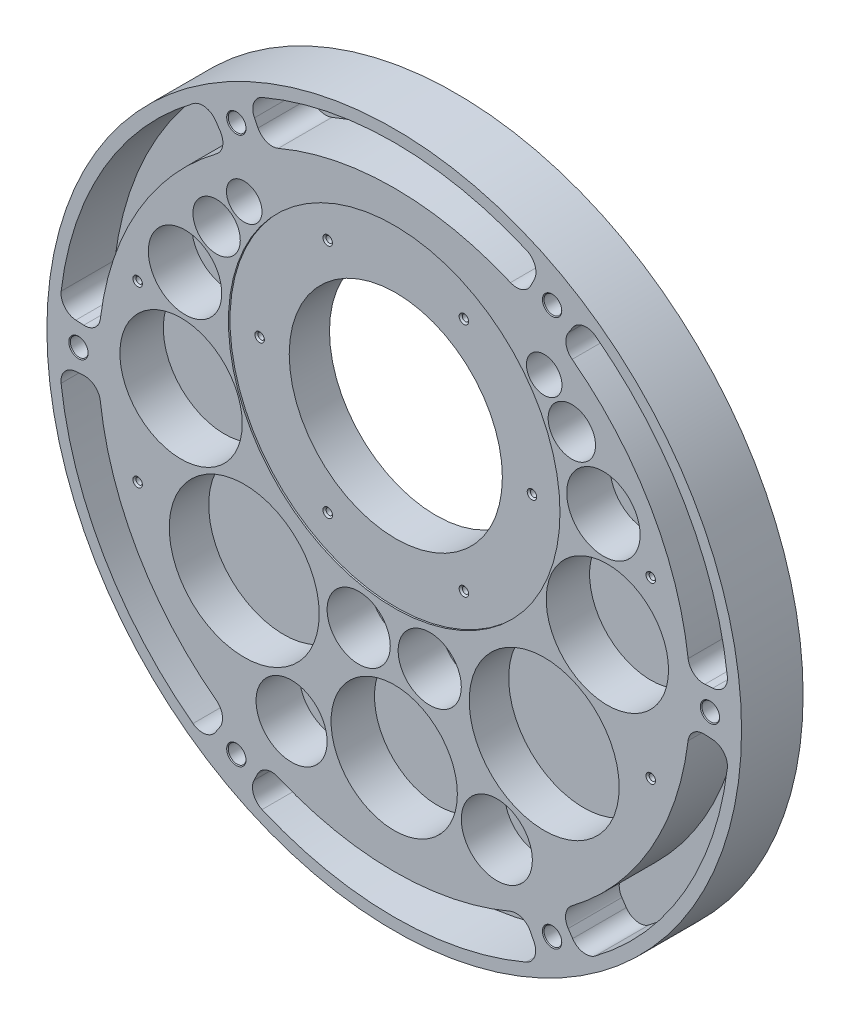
from build123d import *

# Parameters (mm, degrees)
SKETCH1_R                                             = 279.4
BOSS_EXTRUDE1_T_1_875_DEPTH                           = 49.53
MOUNTING_BOLT_PATTER_9_16_0_5625_D_2_COUNT            = 2
MOUNTING_BOLT_PATTER_9_16_0_5625_D_2_PITCH            = 254
MOUNTING_BOLT_PATTER_9_16_0_5625_D_3_COUNT            = 2
MOUNTING_BOLT_PATTER_9_16_0_5625_D_3_PITCH            = 439.940905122
MOUNTING_BOLT_PATTER_9_16_0_5625_D_4_COUNT            = 2
MOUNTING_BOLT_PATTER_9_16_0_5625_D_4_PITCH            = 508
MOUNTING_BOLT_PATTER_9_16_0_5625_D_5_COUNT            = 2
MOUNTING_BOLT_PATTER_9_16_0_5625_D_5_PITCH            = 439.940905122
MOUNTING_BOLT_PATTER_9_16_0_5625_D_6_COUNT            = 2
MOUNTING_BOLT_PATTER_9_16_0_5625_D_6_PITCH            = 254
SKETCH5_R                                             = 85.725
LIGHT_PASS_THRU_HOLE_DIA_5_25_DEPTH                   = 399.223481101
SKETCH6_R                                             = 133.35
SNOOT_PLATE_SPOTFACE_DIA_10_50_DEPTH_DEPTH            = 1.27
F_1_4_20_SNOOT_PLATE_MOUNTING_TAPPED_HOLE_D           = 5.1054
F_1_4_20_SNOOT_PLATE_MOUNTING_TAPPED_HOLE_DEPTH       = 14.976183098
F_1_4_20_SNOOT_PLATE_MOUNTING_TAPPED_HOLE_CSINK_D     = 7.62
F_1_4_20_SNOOT_PLATE_MOUNTING_TAPPED_HOLE_CSINK_ANGLE = 90
F_1_4_20_SNOOT_PLATE_MOUNTING_TAPPED_HOLE_TIP         = 1.533816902
SKETCH10_R                                            = 203.2
BACKSIDE_RELEIF_DIA_16_DEPTH_0_375_DEPTH              = 9.525
PERIMETER_POCKETING_DEPTH                             = 43.18
SKETCH33_R                                            = 14.2875
UPPER_1_HOLES_DEPTH_1_375_DEPTH                       = 34.925
SKETCH21_R                                            = 19.05
UPPER_1_5_HOLES_DEPTH_1_375_DEPTH                     = 34.925
SKETCH22_R                                            = 29.5275
MIDDLE_2_25_HOLES_DEPTH_1_375_DEPTH                   = 34.925
SKETCH23_R                                            = 49.2125
MIDDLE_3_625_HOLES_DEPTH_1_375_DEPTH                  = 34.925
SKETCH24_R                                            = 60.325
LOWER_4_875_HOLES_DEPTH_1_250_DEPTH                   = 31.75
SKETCH32_R                                            = 25.4
SKETCH32_R_2                                          = 50.8
SKETCH32_R_3                                          = 28.575
BOTTOM_5_HOLES_DEPTH_1_375_DEPTH                      = 34.925
SKETCH38_R                                            = 114.3
BACK_9_RELEIF_DEPTH_0_250_DEPTH                       = 6.35
F_1_4_20_TAPPED_HOLE1_D                               = 5.1054
F_1_4_20_TAPPED_HOLE1_DEPTH                           = 14.468183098
F_1_4_20_TAPPED_HOLE1_CSINK_D                         = 7.62
F_1_4_20_TAPPED_HOLE1_CSINK_ANGLE                     = 90
F_1_4_20_TAPPED_HOLE1_TIP                             = 1.533816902


with BuildPart() as part:
    # Sketch1 → Boss-Extrude1 _t_1.875 (new body)
    with BuildSketch(Plane.XY):
        Circle(SKETCH1_R)
    extrude(amount=BOSS_EXTRUDE1_T_1_875_DEPTH)

    # Sketch3 → Mounting Bolt Patter 9_16 _0.5625_ Diame (revolve, cut)
    with BuildSketch(Plane(origin=(127, 219.970452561, 49.53), x_dir=(0, -1, 0), z_dir=(1, 0, 0))):
        Polygon((0, 0), (0, 49.53), (7.77875, 49.53), (7.14375, 48.895), (7.14375, 0.635), (7.77875, 0), align=None)
    mounting_bolt_patter_9_16_0_5625_diame = revolve(axis=Axis((127, 219.970452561, 55.88), (0, 0, -1)), mode=Mode.SUBTRACT)

    # Mounting Bolt Patter 9_16 _0.5625_ D 2: Mounting Bolt Patter 9_16 _0.5625_ Diame ×2
    with Locations(*[Vector(0.5000000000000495, -0.8660254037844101, 0) * (i * MOUNTING_BOLT_PATTER_9_16_0_5625_D_2_PITCH) for i in range(1, MOUNTING_BOLT_PATTER_9_16_0_5625_D_2_COUNT)]):
        add(mounting_bolt_patter_9_16_0_5625_diame, mode=Mode.SUBTRACT)

    # Mounting Bolt Patter 9_16 _0.5625_ D 3: Mounting Bolt Patter 9_16 _0.5625_ Diame ×2
    with Locations(*[(0, -i * MOUNTING_BOLT_PATTER_9_16_0_5625_D_3_PITCH, 0) for i in range(1, MOUNTING_BOLT_PATTER_9_16_0_5625_D_3_COUNT)]):
        add(mounting_bolt_patter_9_16_0_5625_diame, mode=Mode.SUBTRACT)

    # Mounting Bolt Patter 9_16 _0.5625_ D 4: Mounting Bolt Patter 9_16 _0.5625_ Diame ×2
    with Locations(*[Vector(-0.4999999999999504, -0.8660254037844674, 0) * (i * MOUNTING_BOLT_PATTER_9_16_0_5625_D_4_PITCH) for i in range(1, MOUNTING_BOLT_PATTER_9_16_0_5625_D_4_COUNT)]):
        add(mounting_bolt_patter_9_16_0_5625_diame, mode=Mode.SUBTRACT)

    # Mounting Bolt Patter 9_16 _0.5625_ D 5: Mounting Bolt Patter 9_16 _0.5625_ Diame ×2
    with Locations(*[Vector(-0.8660254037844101, -0.5000000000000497, 0) * (i * MOUNTING_BOLT_PATTER_9_16_0_5625_D_5_PITCH) for i in range(1, MOUNTING_BOLT_PATTER_9_16_0_5625_D_5_COUNT)]):
        add(mounting_bolt_patter_9_16_0_5625_diame, mode=Mode.SUBTRACT)

    # Mounting Bolt Patter 9_16 _0.5625_ D 6: Mounting Bolt Patter 9_16 _0.5625_ Diame ×2
    with Locations(*[(-i * MOUNTING_BOLT_PATTER_9_16_0_5625_D_6_PITCH, 0, 0) for i in range(1, MOUNTING_BOLT_PATTER_9_16_0_5625_D_6_COUNT)]):
        add(mounting_bolt_patter_9_16_0_5625_diame, mode=Mode.SUBTRACT)

    # Sketch5 → Light Pass Thru Hole _dia_5.25 (cut, through all)
    with BuildSketch(Plane.XY.offset(49.53)):
        with Locations((0, 78.7908)):
            Circle(SKETCH5_R)
    extrude(amount=-LIGHT_PASS_THRU_HOLE_DIA_5_25_DEPTH, mode=Mode.SUBTRACT)

    # Sketch6 → Snoot Plate SpotFace _dia_10.50_ - depth (cut)
    with BuildSketch(Plane.XY.offset(49.53)):
        with Locations((0, 78.7908)):
            Circle(SKETCH6_R)
    extrude(amount=-SNOOT_PLATE_SPOTFACE_DIA_10_50_DEPTH_DEPTH, mode=Mode.SUBTRACT)

    # 1_4-20 Snoot Plate Mounting Tapped Hole
    with Locations(Plane.XY.offset(48.26)):
        with Locations((-109.5375, 78.7908), (-54.76875, 173.653057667), (54.76875, 173.653057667), (109.5375, 78.7908), (54.76875, -16.071457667), (-54.76875, -16.071457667)):
            CounterSinkHole(F_1_4_20_SNOOT_PLATE_MOUNTING_TAPPED_HOLE_D / 2, F_1_4_20_SNOOT_PLATE_MOUNTING_TAPPED_HOLE_CSINK_D / 2, depth=F_1_4_20_SNOOT_PLATE_MOUNTING_TAPPED_HOLE_DEPTH, counter_sink_angle=F_1_4_20_SNOOT_PLATE_MOUNTING_TAPPED_HOLE_CSINK_ANGLE)
            with Locations((0, 0, -(F_1_4_20_SNOOT_PLATE_MOUNTING_TAPPED_HOLE_DEPTH + F_1_4_20_SNOOT_PLATE_MOUNTING_TAPPED_HOLE_TIP / 2))):  # 118° drill point
                Cone(0, F_1_4_20_SNOOT_PLATE_MOUNTING_TAPPED_HOLE_D / 2, F_1_4_20_SNOOT_PLATE_MOUNTING_TAPPED_HOLE_TIP, mode=Mode.SUBTRACT)

    # Sketch10 → Backside Releif _dia_16_ - depth_0.375 (cut)
    with BuildSketch(Plane(origin=(0, 0, 0), x_dir=(-1, 0, 0), z_dir=(0, 0, -1))):
        Circle(SKETCH10_R)
    extrude(amount=-BACKSIDE_RELEIF_DIA_16_DEPTH_0_375_DEPTH, mode=Mode.SUBTRACT)

    # Sketch11 → Perimeter Pocketing (cut)
    with BuildSketch(Plane.XY.offset(49.53)):
        with BuildLine():
            Line((109.936092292, 225.098489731), (112.72316283, 230.812831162))
            ThreePointArc((112.72316283, 230.812831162), (113.211926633, 240.807098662), (106.311366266, 248.053238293))
            ThreePointArc((106.311366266, 248.053238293), (0.139468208, 269.874963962), (-106.054927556, 248.162986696))
            ThreePointArc((-106.054927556, 248.162986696), (-112.991072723, 240.847926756), (-112.412674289, 230.783848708))
            Line((-112.412674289, 230.783848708), (-109.556670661, 225.098489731))
            ThreePointArc((-109.556670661, 225.098489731), (-102.58062099, 218.875817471), (-93.23554159, 219.113325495))
            ThreePointArc((-93.23554159, 219.113325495), (0.161670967, 238.124945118), (93.532982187, 218.986522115))
            ThreePointArc((93.532982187, 218.986522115), (102.955732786, 218.765098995), (109.936092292, 225.098489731))
        make_face()
        with BuildLine():
            Line((140.16267513, 207.428104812), (143.65833862, 212.744155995))
            ThreePointArc((143.65833862, 212.744155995), (152.084886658, 218.277102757), (161.88798698, 215.927754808))
            ThreePointArc((161.88798698, 215.927754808), (233.788308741, 134.81669897), (267.976088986, 31.958275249))
            ThreePointArc((267.976088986, 31.958275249), (265.15102817, 22.359144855), (256.251356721, 17.785292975))
            Line((256.251356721, 17.785292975), (249.909056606, 17.341796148))
            ThreePointArc((249.909056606, 17.341796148), (240.933999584, 20.22026944), (236.414382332, 28.491322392))
            ThreePointArc((236.414382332, 28.491322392), (206.30308723, 118.922461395), (143.139935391, 190.3010103))
            ThreePointArc((143.139935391, 190.3010103), (138.261707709, 198.275332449), (140.16267513, 207.428104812))
        make_face()
        with BuildLine():
            Line((249.719345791, -17.670384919), (256.071012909, -18.039692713))
            ThreePointArc((256.071012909, -18.039692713), (265.075959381, -22.570823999), (267.942914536, -32.235231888))
            ThreePointArc((267.942914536, -32.235231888), (233.648840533, -135.058264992), (161.664722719, -216.094963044))
            ThreePointArc((161.664722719, -216.094963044), (151.939101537, -218.447953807), (143.528193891, -213.027538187))
            Line((143.528193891, -213.027538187), (139.972964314, -207.756693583))
            ThreePointArc((139.972964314, -207.756693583), (137.978266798, -198.544829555), (142.881400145, -190.495199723))
            ThreePointArc((142.881400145, -190.495199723), (206.141416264, -119.202483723), (236.375476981, -28.812315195))
            ThreePointArc((236.375476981, -28.812315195), (240.842328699, -20.600485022), (249.719345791, -17.670384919))
        make_face()
        with BuildLine():
            Line((109.556670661, -225.098489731), (112.412674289, -230.783848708))
            ThreePointArc((112.412674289, -230.783848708), (112.991072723, -240.847926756), (106.054927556, -248.162986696))
            ThreePointArc((106.054927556, -248.162986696), (-0.139468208, -269.874963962), (-106.311366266, -248.053238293))
            ThreePointArc((-106.311366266, -248.053238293), (-113.211926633, -240.807098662), (-112.72316283, -230.812831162))
            Line((-112.72316283, -230.812831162), (-109.936092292, -225.098489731))
            ThreePointArc((-109.936092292, -225.098489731), (-102.955732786, -218.765098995), (-93.532982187, -218.986522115))
            ThreePointArc((-93.532982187, -218.986522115), (-0.161670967, -238.124945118), (93.23554159, -219.113325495))
            ThreePointArc((93.23554159, -219.113325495), (102.58062099, -218.875817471), (109.556670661, -225.098489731))
        make_face()
        with BuildLine():
            Line((-140.16267513, -207.428104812), (-143.65833862, -212.744155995))
            ThreePointArc((-143.65833862, -212.744155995), (-152.084886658, -218.277102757), (-161.88798698, -215.927754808))
            ThreePointArc((-161.88798698, -215.927754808), (-233.788308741, -134.81669897), (-267.976088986, -31.958275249))
            ThreePointArc((-267.976088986, -31.958275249), (-265.15102817, -22.359144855), (-256.251356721, -17.785292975))
            Line((-256.251356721, -17.785292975), (-249.909056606, -17.341796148))
            ThreePointArc((-249.909056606, -17.341796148), (-240.933999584, -20.22026944), (-236.414382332, -28.491322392))
            ThreePointArc((-236.414382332, -28.491322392), (-206.30308723, -118.922461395), (-143.139935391, -190.3010103))
            ThreePointArc((-143.139935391, -190.3010103), (-138.261707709, -198.275332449), (-140.16267513, -207.428104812))
        make_face()
        with BuildLine():
            Line((-249.719345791, 17.670384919), (-256.071012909, 18.039692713))
            ThreePointArc((-256.071012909, 18.039692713), (-265.075959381, 22.570823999), (-267.942914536, 32.235231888))
            ThreePointArc((-267.942914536, 32.235231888), (-233.648840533, 135.058264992), (-161.664722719, 216.094963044))
            ThreePointArc((-161.664722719, 216.094963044), (-151.939101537, 218.447953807), (-143.528193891, 213.027538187))
            Line((-143.528193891, 213.027538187), (-139.972964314, 207.756693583))
            ThreePointArc((-139.972964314, 207.756693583), (-137.978266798, 198.544829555), (-142.881400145, 190.495199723))
            ThreePointArc((-142.881400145, 190.495199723), (-206.141416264, 119.202483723), (-236.375476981, 28.812315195))
            ThreePointArc((-236.375476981, 28.812315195), (-240.842328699, 20.600485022), (-249.719345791, 17.670384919))
        make_face()
    extrude(amount=-PERIMETER_POCKETING_DEPTH, mode=Mode.SUBTRACT)

    # Sketch33 → Upper 1_ Holes _Depth_1.375 (cut)
    with BuildSketch(Plane.XY.offset(49.53)):
        with Locations((-120.65, 168.275)):
            Circle(SKETCH33_R)
        with Locations((120.65, 168.275)):
            Circle(SKETCH33_R)
    extrude(amount=-UPPER_1_HOLES_DEPTH_1_375_DEPTH, mode=Mode.SUBTRACT)

    # Sketch21 → Upper 1.5_ Holes _depth_1.375 (cut)
    with BuildSketch(Plane.XY.offset(49.53)):
        with Locations((-142.875, 139.7)):
            Circle(SKETCH21_R)
        with Locations((142.875, 139.7)):
            Circle(SKETCH21_R)
    extrude(amount=-UPPER_1_5_HOLES_DEPTH_1_375_DEPTH, mode=Mode.SUBTRACT)

    # Sketch22 → Middle 2.25_ Holes _depth_1.375 (cut)
    with BuildSketch(Plane.XY.offset(49.53)):
        with Locations((-168.275, 95.25)):
            Circle(SKETCH22_R)
        with Locations((168.275, 95.25)):
            Circle(SKETCH22_R)
    extrude(amount=-MIDDLE_2_25_HOLES_DEPTH_1_375_DEPTH, mode=Mode.SUBTRACT)

    # Sketch23 → Middle 3.625 Holes _depth_1.375 (cut)
    with BuildSketch(Plane.XY.offset(49.53)):
        with Locations((-171.45, 12.7)):
            Circle(SKETCH23_R)
        with Locations((171.45, 12.7)):
            Circle(SKETCH23_R)
    extrude(amount=-MIDDLE_3_625_HOLES_DEPTH_1_375_DEPTH, mode=Mode.SUBTRACT)

    # Sketch24 → Lower 4.875_ Holes _depth_1.250 (cut)
    with BuildSketch(Plane.XY.offset(49.53)):
        with Locations((-120.65, -88.9)):
            Circle(SKETCH24_R)
        with Locations((120.65, -88.9)):
            Circle(SKETCH24_R)
    extrude(amount=-LOWER_4_875_HOLES_DEPTH_1_250_DEPTH, mode=Mode.SUBTRACT)

    # Sketch32 → Bottom 5 Holes _Depth_1.375 (cut)
    with BuildSketch(Plane.XY.offset(49.53)):
        with Locations((-28.575, -82.55)):
            Circle(SKETCH32_R)
        with Locations((28.575, -82.55)):
            Circle(SKETCH32_R)
        with Locations((0, -158.75)):
            Circle(SKETCH32_R_2)
        with Locations((-82.55, -174.625)):
            Circle(SKETCH32_R_3)
        with Locations((82.55, -174.625)):
            Circle(SKETCH32_R_3)
    extrude(amount=-BOTTOM_5_HOLES_DEPTH_1_375_DEPTH, mode=Mode.SUBTRACT)

    # Sketch38 → Back 9_ Releif _Depth_0.250 (cut)
    with BuildSketch(Plane(origin=(0, 0, 9.525), x_dir=(-1, 0, 0), z_dir=(0, 0, -1))):
        with Locations((0, 78.7908)):
            Circle(SKETCH38_R)
    extrude(amount=-BACK_9_RELEIF_DEPTH_0_250_DEPTH, mode=Mode.SUBTRACT)

    # 1_4-20 Tapped Hole1
    with Locations(Plane.XY.offset(49.53)):
        with Locations((-206.375, 69.977), (-206.375, -69.977), (206.375, -69.977), (206.375, 69.977)):
            CounterSinkHole(F_1_4_20_TAPPED_HOLE1_D / 2, F_1_4_20_TAPPED_HOLE1_CSINK_D / 2, depth=F_1_4_20_TAPPED_HOLE1_DEPTH, counter_sink_angle=F_1_4_20_TAPPED_HOLE1_CSINK_ANGLE)
            with Locations((0, 0, -(F_1_4_20_TAPPED_HOLE1_DEPTH + F_1_4_20_TAPPED_HOLE1_TIP / 2))):  # 118° drill point
                Cone(0, F_1_4_20_TAPPED_HOLE1_D / 2, F_1_4_20_TAPPED_HOLE1_TIP, mode=Mode.SUBTRACT)


solid = part.part
